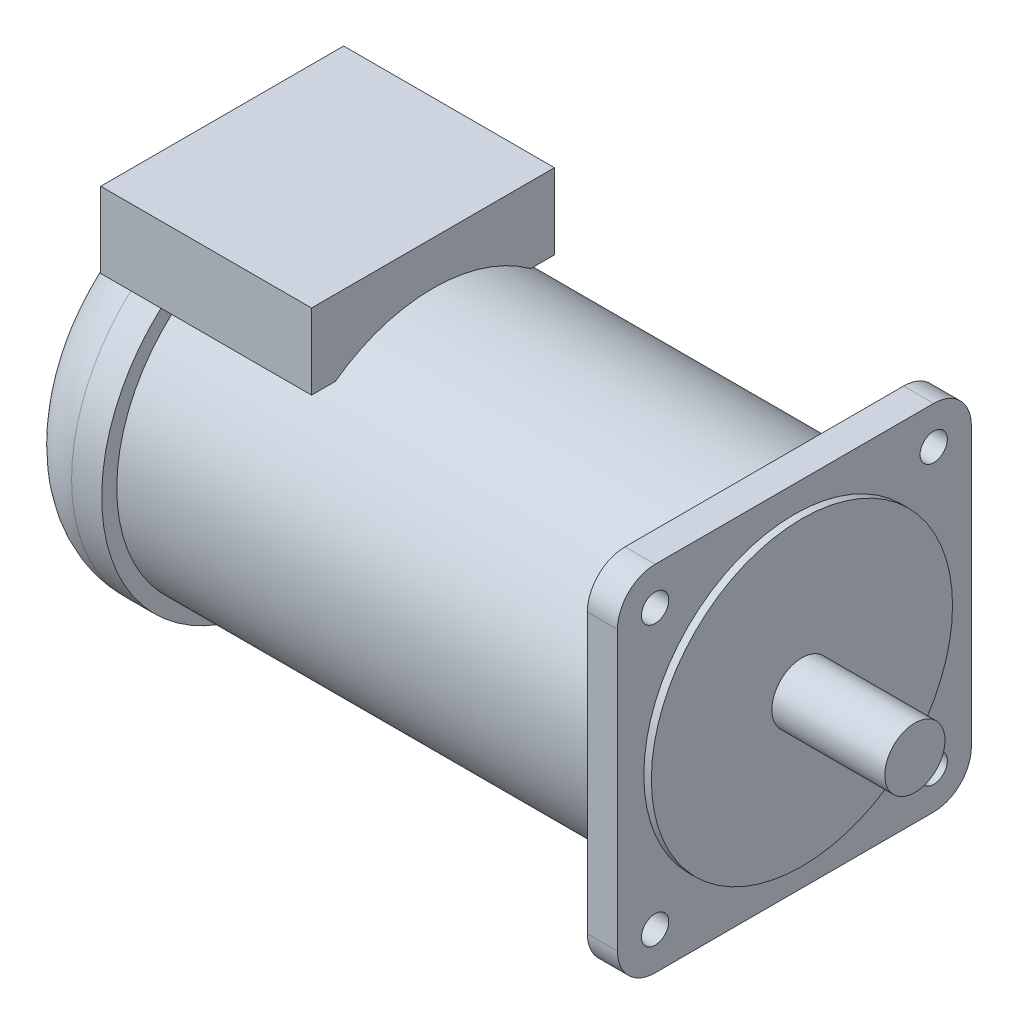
ISO-10303-21;
HEADER;
FILE_DESCRIPTION(('STEP AP214'),'2;1');
FILE_NAME('part.step','',(''),(''),'','','');
FILE_SCHEMA(('AUTOMOTIVE_DESIGN { 1 0 10303 214 1 1 1 1 }'));
ENDSEC;
DATA;
#1=APPLICATION_CONTEXT('core data for automotive mechanical design processes');
#2=APPLICATION_PROTOCOL_DEFINITION('international standard','automotive_design',2000,#1);
#3=PRODUCT_CONTEXT('',#1,'mechanical');
#4=PRODUCT('Part','Part','',(#3));
#5=PRODUCT_RELATED_PRODUCT_CATEGORY('part','',(#4));
#6=PRODUCT_DEFINITION_FORMATION('','',#4);
#7=PRODUCT_DEFINITION_CONTEXT('part definition',#1,'design');
#8=PRODUCT_DEFINITION('design','',#6,#7);
#9=PRODUCT_DEFINITION_SHAPE('','',#8);
#10=(LENGTH_UNIT() NAMED_UNIT(*) SI_UNIT(.MILLI.,.METRE.));
#11=(NAMED_UNIT(*) PLANE_ANGLE_UNIT() SI_UNIT($,.RADIAN.));
#12=(NAMED_UNIT(*) SI_UNIT($,.STERADIAN.) SOLID_ANGLE_UNIT());
#13=UNCERTAINTY_MEASURE_WITH_UNIT(LENGTH_MEASURE(1.E-05),#10,'distance_accuracy_value','');
#14=(GEOMETRIC_REPRESENTATION_CONTEXT(3) GLOBAL_UNCERTAINTY_ASSIGNED_CONTEXT((#13)) GLOBAL_UNIT_ASSIGNED_CONTEXT((#10,
#11,#12)) REPRESENTATION_CONTEXT('',''));
#15=CARTESIAN_POINT('',(0.,0.,0.));
#16=DIRECTION('',(0.,0.,1.));
#17=DIRECTION('',(1.,0.,0.));
#18=AXIS2_PLACEMENT_3D('',#15,#16,#17);
#19=CARTESIAN_POINT('',(-50.8,12.7,0.));
#20=DIRECTION('',(-1.,0.,0.));
#21=DIRECTION('',(0.,0.,1.));
#22=AXIS2_PLACEMENT_3D('',#19,#20,#21);
#23=PLANE('',#22);
#24=CARTESIAN_POINT('',(-50.8,58.7375000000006,-58.7374999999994));
#25=DIRECTION('',(-1.,0.,0.));
#26=DIRECTION('',(0.,0.,1.));
#27=AXIS2_PLACEMENT_3D('',#24,#25,#26);
#28=CIRCLE('',#27,5.75436999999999);
#29=CARTESIAN_POINT('',(-50.8,58.7375000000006,-52.9831299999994));
#30=VERTEX_POINT('',#29);
#31=EDGE_CURVE('E523',#30,#30,#28,.T.);
#32=ORIENTED_EDGE('',*,*,#31,.T.);
#33=EDGE_LOOP('',(#32));
#34=FACE_BOUND('',#33,.T.);
#35=CARTESIAN_POINT('',(-50.8,-58.7374999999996,-58.7375000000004));
#36=DIRECTION('',(-1.,0.,0.));
#37=DIRECTION('',(0.,0.,1.));
#38=AXIS2_PLACEMENT_3D('',#35,#36,#37);
#39=CIRCLE('',#38,5.75436999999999);
#40=CARTESIAN_POINT('',(-50.8,-58.7374999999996,-52.9831300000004));
#41=VERTEX_POINT('',#40);
#42=EDGE_CURVE('E527',#41,#41,#39,.T.);
#43=ORIENTED_EDGE('',*,*,#42,.T.);
#44=EDGE_LOOP('',(#43));
#45=FACE_BOUND('',#44,.T.);
#46=CARTESIAN_POINT('',(-50.8,-58.7375000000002,58.7374999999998));
#47=DIRECTION('',(-1.,0.,0.));
#48=DIRECTION('',(0.,0.,1.));
#49=AXIS2_PLACEMENT_3D('',#46,#47,#48);
#50=CIRCLE('',#49,5.75436999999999);
#51=CARTESIAN_POINT('',(-50.8,-58.7375000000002,64.4918699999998));
#52=VERTEX_POINT('',#51);
#53=EDGE_CURVE('E536',#52,#52,#50,.T.);
#54=ORIENTED_EDGE('',*,*,#53,.T.);
#55=EDGE_LOOP('',(#54));
#56=FACE_BOUND('',#55,.T.);
#57=CARTESIAN_POINT('',(-50.8,58.7375,58.7375));
#58=DIRECTION('',(-1.,0.,0.));
#59=DIRECTION('',(0.,0.,1.));
#60=AXIS2_PLACEMENT_3D('',#57,#58,#59);
#61=CIRCLE('',#60,5.75436999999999);
#62=CARTESIAN_POINT('',(-50.8,58.7375,64.49187));
#63=VERTEX_POINT('',#62);
#64=EDGE_CURVE('E541',#63,#63,#61,.T.);
#65=ORIENTED_EDGE('',*,*,#64,.T.);
#66=EDGE_LOOP('',(#65));
#67=FACE_BOUND('',#66,.T.);
#68=CARTESIAN_POINT('',(-50.8,58.7375,-58.7375));
#69=DIRECTION('',(1.,0.,0.));
#70=DIRECTION('',(0.,0.,-1.));
#71=AXIS2_PLACEMENT_3D('',#68,#69,#70);
#72=CIRCLE('',#71,15.875);
#73=CARTESIAN_POINT('',(-50.8,58.7375,-74.6125));
#74=VERTEX_POINT('',#73);
#75=CARTESIAN_POINT('',(-50.8,74.6125,-58.7375));
#76=VERTEX_POINT('',#75);
#77=EDGE_CURVE('E209',#74,#76,#72,.T.);
#78=ORIENTED_EDGE('',*,*,#77,.T.);
#79=DIRECTION('',(0.,0.,1.));
#80=VECTOR('',#79,1.);
#81=CARTESIAN_POINT('',(-50.8,74.6125,-58.7375));
#82=LINE('',#81,#80);
#83=CARTESIAN_POINT('',(-50.8,74.6125,58.7375));
#84=VERTEX_POINT('',#83);
#85=EDGE_CURVE('E212',#76,#84,#82,.T.);
#86=ORIENTED_EDGE('',*,*,#85,.T.);
#87=CARTESIAN_POINT('',(-50.8,58.7375,58.7375));
#88=DIRECTION('',(-1.,0.,0.));
#89=DIRECTION('',(0.,0.,1.));
#90=AXIS2_PLACEMENT_3D('',#87,#88,#89);
#91=CIRCLE('',#90,15.875);
#92=CARTESIAN_POINT('',(-50.8,58.7375,74.6125));
#93=VERTEX_POINT('',#92);
#94=EDGE_CURVE('E215',#93,#84,#91,.T.);
#95=ORIENTED_EDGE('',*,*,#94,.F.);
#96=DIRECTION('',(0.,1.,0.));
#97=VECTOR('',#96,1.);
#98=CARTESIAN_POINT('',(-50.8,-58.7375,74.6125));
#99=LINE('',#98,#97);
#100=CARTESIAN_POINT('',(-50.8,-58.7375,74.6125));
#101=VERTEX_POINT('',#100);
#102=EDGE_CURVE('E218',#101,#93,#99,.T.);
#103=ORIENTED_EDGE('',*,*,#102,.F.);
#104=CARTESIAN_POINT('',(-50.8,-58.7375,58.7375));
#105=DIRECTION('',(1.,0.,0.));
#106=DIRECTION('',(0.,0.,-1.));
#107=AXIS2_PLACEMENT_3D('',#104,#105,#106);
#108=CIRCLE('',#107,15.875);
#109=CARTESIAN_POINT('',(-50.8,-74.6125,58.7375));
#110=VERTEX_POINT('',#109);
#111=EDGE_CURVE('E220',#101,#110,#108,.T.);
#112=ORIENTED_EDGE('',*,*,#111,.T.);
#113=DIRECTION('',(0.,0.,1.));
#114=VECTOR('',#113,1.);
#115=CARTESIAN_POINT('',(-50.8,-74.6125,-58.7375));
#116=LINE('',#115,#114);
#117=CARTESIAN_POINT('',(-50.8,-74.6125,-58.7375));
#118=VERTEX_POINT('',#117);
#119=EDGE_CURVE('E223',#118,#110,#116,.T.);
#120=ORIENTED_EDGE('',*,*,#119,.F.);
#121=CARTESIAN_POINT('',(-50.8,-58.7375,-58.7375));
#122=DIRECTION('',(-1.,0.,0.));
#123=DIRECTION('',(0.,0.,1.));
#124=AXIS2_PLACEMENT_3D('',#121,#122,#123);
#125=CIRCLE('',#124,15.875);
#126=CARTESIAN_POINT('',(-50.8,-58.7375,-74.6125));
#127=VERTEX_POINT('',#126);
#128=EDGE_CURVE('E226',#127,#118,#125,.T.);
#129=ORIENTED_EDGE('',*,*,#128,.F.);
#130=DIRECTION('',(0.,1.,0.));
#131=VECTOR('',#130,1.);
#132=CARTESIAN_POINT('',(-50.8,-58.7375,-74.6125));
#133=LINE('',#132,#131);
#134=EDGE_CURVE('E228',#127,#74,#133,.T.);
#135=ORIENTED_EDGE('',*,*,#134,.T.);
#136=EDGE_LOOP('',(#78,#86,#95,#103,#112,#120,#129,#135));
#137=FACE_BOUND('',#136,.T.);
#138=CARTESIAN_POINT('',(-50.8,0.,0.));
#139=DIRECTION('',(-1.,0.,0.));
#140=DIRECTION('',(0.,0.,1.));
#141=AXIS2_PLACEMENT_3D('',#138,#139,#140);
#142=CIRCLE('',#141,63.5);
#143=CARTESIAN_POINT('',(-50.8,0.,63.5));
#144=VERTEX_POINT('',#143);
#145=EDGE_CURVE('E11',#144,#144,#142,.F.);
#146=ORIENTED_EDGE('',*,*,#145,.F.);
#147=EDGE_LOOP('',(#146));
#148=FACE_BOUND('',#147,.T.);
#149=ADVANCED_FACE('F30',(#34,#45,#56,#67,#137,#148),#23,.F.);
#150=CARTESIAN_POINT('',(0.,0.,0.));
#151=DIRECTION('',(-1.,0.,0.));
#152=DIRECTION('',(0.,0.,1.));
#153=AXIS2_PLACEMENT_3D('',#150,#151,#152);
#154=CYLINDRICAL_SURFACE('',#153,69.85);
#155=CARTESIAN_POINT('',(-63.5,0.,0.));
#156=DIRECTION('',(1.,0.,0.));
#157=DIRECTION('',(0.,0.,-1.));
#158=AXIS2_PLACEMENT_3D('',#155,#156,#157);
#159=CIRCLE('',#158,69.85);
#160=CARTESIAN_POINT('',(-63.5,0.,-69.85));
#161=VERTEX_POINT('',#160);
#162=EDGE_CURVE('E284',#161,#161,#159,.T.);
#163=ORIENTED_EDGE('',*,*,#162,.F.);
#164=EDGE_LOOP('',(#163));
#165=FACE_BOUND('',#164,.T.);
#166=DIRECTION('',(-1.,0.,0.));
#167=VECTOR('',#166,1.);
#168=CARTESIAN_POINT('',(0.,56.4141009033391,-41.1882473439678));
#169=LINE('',#168,#167);
#170=CARTESIAN_POINT('',(-203.2,56.4141009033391,-41.1882473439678));
#171=VERTEX_POINT('',#170);
#172=CARTESIAN_POINT('',(-266.7,56.4141009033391,-41.1882473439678));
#173=VERTEX_POINT('',#172);
#174=EDGE_CURVE('E50',#171,#173,#169,.T.);
#175=ORIENTED_EDGE('',*,*,#174,.F.);
#176=CARTESIAN_POINT('',(-203.2,0.,0.));
#177=DIRECTION('',(1.,0.,0.));
#178=DIRECTION('',(0.,0.,-1.));
#179=AXIS2_PLACEMENT_3D('',#176,#177,#178);
#180=CIRCLE('',#179,69.85);
#181=CARTESIAN_POINT('',(-203.2,56.4141009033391,41.1882473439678));
#182=VERTEX_POINT('',#181);
#183=EDGE_CURVE('E39',#171,#182,#180,.T.);
#184=ORIENTED_EDGE('',*,*,#183,.T.);
#185=DIRECTION('',(-1.,0.,0.));
#186=VECTOR('',#185,1.);
#187=CARTESIAN_POINT('',(0.,56.4141009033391,41.1882473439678));
#188=LINE('',#187,#186);
#189=CARTESIAN_POINT('',(-266.7,56.4141009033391,41.1882473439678));
#190=VERTEX_POINT('',#189);
#191=EDGE_CURVE('E164',#190,#182,#188,.F.);
#192=ORIENTED_EDGE('',*,*,#191,.F.);
#193=CARTESIAN_POINT('',(-266.7,0.,0.));
#194=DIRECTION('',(-1.,0.,0.));
#195=DIRECTION('',(0.,0.,1.));
#196=AXIS2_PLACEMENT_3D('',#193,#194,#195);
#197=CIRCLE('',#196,69.85);
#198=EDGE_CURVE('E278',#173,#190,#197,.T.);
#199=ORIENTED_EDGE('',*,*,#198,.F.);
#200=EDGE_LOOP('',(#175,#184,#192,#199));
#201=FACE_BOUND('',#200,.T.);
#202=ADVANCED_FACE('F359',(#165,#201),#154,.T.);
#203=CARTESIAN_POINT('',(-266.7,69.85,0.));
#204=DIRECTION('',(-1.,0.,0.));
#205=DIRECTION('',(0.,0.,1.));
#206=AXIS2_PLACEMENT_3D('',#203,#204,#205);
#207=PLANE('',#206);
#208=DIRECTION('',(0.,0.,-1.));
#209=VECTOR('',#208,1.);
#210=CARTESIAN_POINT('',(-266.7,56.4141009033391,0.));
#211=LINE('',#210,#209);
#212=CARTESIAN_POINT('',(-266.7,56.4141009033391,51.2239125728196));
#213=VERTEX_POINT('',#212);
#214=EDGE_CURVE('E206',#213,#190,#211,.T.);
#215=ORIENTED_EDGE('',*,*,#214,.F.);
#216=CARTESIAN_POINT('',(-266.7,0.,0.));
#217=DIRECTION('',(-1.,0.,0.));
#218=DIRECTION('',(0.,0.,1.));
#219=AXIS2_PLACEMENT_3D('',#216,#217,#218);
#220=CIRCLE('',#219,76.2);
#221=CARTESIAN_POINT('',(-266.7,56.4141009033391,-51.2239125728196));
#222=VERTEX_POINT('',#221);
#223=EDGE_CURVE('E275',#222,#213,#220,.T.);
#224=ORIENTED_EDGE('',*,*,#223,.F.);
#225=EDGE_CURVE('E196',#173,#222,#211,.T.);
#226=ORIENTED_EDGE('',*,*,#225,.F.);
#227=ORIENTED_EDGE('',*,*,#198,.T.);
#228=EDGE_LOOP('',(#215,#224,#226,#227));
#229=FACE_BOUND('',#228,.T.);
#230=ADVANCED_FACE('F366',(#229),#207,.F.);
#231=CARTESIAN_POINT('',(0.,0.,0.));
#232=DIRECTION('',(-1.,0.,0.));
#233=DIRECTION('',(0.,0.,1.));
#234=AXIS2_PLACEMENT_3D('',#231,#232,#233);
#235=CYLINDRICAL_SURFACE('',#234,76.2);
#236=DIRECTION('',(1.,0.,0.));
#237=VECTOR('',#236,1.);
#238=CARTESIAN_POINT('',(-292.1,56.4141009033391,-51.2239125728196));
#239=LINE('',#238,#237);
#240=CARTESIAN_POINT('',(-279.4,56.4141009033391,-51.2239125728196));
#241=VERTEX_POINT('',#240);
#242=EDGE_CURVE('E201',#241,#222,#239,.T.);
#243=ORIENTED_EDGE('',*,*,#242,.T.);
#244=ORIENTED_EDGE('',*,*,#223,.T.);
#245=DIRECTION('',(1.,0.,0.));
#246=VECTOR('',#245,1.);
#247=CARTESIAN_POINT('',(-292.1,56.4141009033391,51.2239125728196));
#248=LINE('',#247,#246);
#249=CARTESIAN_POINT('',(-279.4,56.4141009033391,51.2239125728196));
#250=VERTEX_POINT('',#249);
#251=EDGE_CURVE('E155',#250,#213,#248,.T.);
#252=ORIENTED_EDGE('',*,*,#251,.F.);
#253=CARTESIAN_POINT('',(-279.4,0.,0.));
#254=DIRECTION('',(-1.,0.,0.));
#255=DIRECTION('',(0.,0.,1.));
#256=AXIS2_PLACEMENT_3D('',#253,#254,#255);
#257=CIRCLE('',#256,76.2);
#258=EDGE_CURVE('E272',#241,#250,#257,.T.);
#259=ORIENTED_EDGE('',*,*,#258,.F.);
#260=EDGE_LOOP('',(#243,#244,#252,#259));
#261=FACE_BOUND('',#260,.T.);
#262=ADVANCED_FACE('F356',(#261),#235,.T.);
#263=CARTESIAN_POINT('',(-279.4,0.,0.));
#264=DIRECTION('',(-1.,0.,0.));
#265=DIRECTION('',(0.,0.,1.));
#266=AXIS2_PLACEMENT_3D('',#263,#264,#265);
#267=TOROIDAL_SURFACE('',#266,50.8,25.4);
#268=CARTESIAN_POINT('',(-304.8,0.,0.));
#269=DIRECTION('',(-1.,0.,0.));
#270=DIRECTION('',(0.,0.,1.));
#271=AXIS2_PLACEMENT_3D('',#268,#269,#270);
#272=CIRCLE('',#271,50.8);
#273=CARTESIAN_POINT('',(-304.8,0.,50.8));
#274=VERTEX_POINT('',#273);
#275=EDGE_CURVE('E254',#274,#274,#272,.T.);
#276=ORIENTED_EDGE('',*,*,#275,.F.);
#277=EDGE_LOOP('',(#276));
#278=FACE_BOUND('',#277,.T.);
#279=CARTESIAN_POINT('',(-304.171795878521,56.4141009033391,0.));
#280=CARTESIAN_POINT('',(-304.171796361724,56.4141009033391,0.956930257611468));
#281=CARTESIAN_POINT('',(-304.166311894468,56.4141009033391,1.91386076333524));
#282=CARTESIAN_POINT('',(-304.143968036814,56.4141009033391,3.82759498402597));
#283=CARTESIAN_POINT('',(-304.127108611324,56.4141009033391,4.78439869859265));
#284=CARTESIAN_POINT('',(-304.080796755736,56.4141009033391,6.6979265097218));
#285=CARTESIAN_POINT('',(-304.051341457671,56.4141009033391,7.65465053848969));
#286=CARTESIAN_POINT('',(-303.977844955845,56.4141009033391,9.5675451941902));
#287=CARTESIAN_POINT('',(-303.933803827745,56.4141009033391,10.5237158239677));
#288=CARTESIAN_POINT('',(-303.828436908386,56.4141009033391,12.4344908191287));
#289=CARTESIAN_POINT('',(-303.767122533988,56.4141009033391,13.3890958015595));
#290=CARTESIAN_POINT('',(-303.62377580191,56.4141009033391,15.2968000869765));
#291=CARTESIAN_POINT('',(-303.54174291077,56.4141009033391,16.2498993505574));
#292=CARTESIAN_POINT('',(-303.35293644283,56.4141009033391,18.1533166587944));
#293=CARTESIAN_POINT('',(-303.246172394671,56.4141009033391,19.1036356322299));
#294=CARTESIAN_POINT('',(-303.003252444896,56.4141009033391,21.0004651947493));
#295=CARTESIAN_POINT('',(-302.867099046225,56.4141009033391,21.9469761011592));
#296=CARTESIAN_POINT('',(-302.528618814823,56.4141009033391,24.0288729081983));
#297=CARTESIAN_POINT('',(-302.318438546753,56.4141009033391,25.1630106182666));
#298=CARTESIAN_POINT('',(-301.8377744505,56.4141009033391,27.4188033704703));
#299=CARTESIAN_POINT('',(-301.567282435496,56.4141009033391,28.5404566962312));
#300=CARTESIAN_POINT('',(-300.955546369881,56.4141009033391,30.7630537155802));
#301=CARTESIAN_POINT('',(-300.614390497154,56.4141009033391,31.8640213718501));
#302=CARTESIAN_POINT('',(-299.849837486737,56.4141009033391,34.0370389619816));
#303=CARTESIAN_POINT('',(-299.426474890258,56.4141009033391,35.1091008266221));
#304=CARTESIAN_POINT('',(-298.632925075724,56.4141009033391,36.8833604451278));
#305=CARTESIAN_POINT('',(-298.287368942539,56.4141009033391,37.5965828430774));
#306=CARTESIAN_POINT('',(-297.548408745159,56.4141009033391,38.9979592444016));
#307=CARTESIAN_POINT('',(-297.155004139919,56.4141009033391,39.6861129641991));
#308=CARTESIAN_POINT('',(-296.317469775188,56.4141009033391,41.0303483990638));
#309=CARTESIAN_POINT('',(-295.873382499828,56.4141009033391,41.6864563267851));
#310=CARTESIAN_POINT('',(-295.167426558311,56.4141009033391,42.6408478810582));
#311=CARTESIAN_POINT('',(-294.925491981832,56.4141009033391,42.9539920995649));
#312=CARTESIAN_POINT('',(-294.428023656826,56.4141009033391,43.5694303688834));
#313=CARTESIAN_POINT('',(-294.172486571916,56.4141009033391,43.8717217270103));
#314=CARTESIAN_POINT('',(-293.508994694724,56.4141009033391,44.6208269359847));
#315=CARTESIAN_POINT('',(-293.091862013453,56.4141009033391,45.0595869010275));
#316=CARTESIAN_POINT('',(-292.22565215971,56.4141009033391,45.9041967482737));
#317=CARTESIAN_POINT('',(-291.776583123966,56.4141009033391,46.3100549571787));
#318=CARTESIAN_POINT('',(-290.847339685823,56.4141009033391,47.0838498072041));
#319=CARTESIAN_POINT('',(-290.367188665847,56.4141009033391,47.4518144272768));
#320=CARTESIAN_POINT('',(-289.376939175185,56.4141009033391,48.1450209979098));
#321=CARTESIAN_POINT('',(-288.866845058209,56.4141009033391,48.470269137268));
#322=CARTESIAN_POINT('',(-287.898794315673,56.4141009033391,49.0270815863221));
#323=CARTESIAN_POINT('',(-287.444700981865,56.4141009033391,49.2653711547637));
#324=CARTESIAN_POINT('',(-286.518747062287,56.4141009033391,49.7045222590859));
#325=CARTESIAN_POINT('',(-286.046888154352,56.4141009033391,49.9053873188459));
#326=CARTESIAN_POINT('',(-285.088097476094,56.4141009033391,50.2668573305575));
#327=CARTESIAN_POINT('',(-284.601169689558,56.4141009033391,50.4274728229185));
#328=CARTESIAN_POINT('',(-283.615232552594,56.4141009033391,50.706106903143));
#329=CARTESIAN_POINT('',(-283.116223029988,56.4141009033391,50.8241248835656));
#330=CARTESIAN_POINT('',(-282.107853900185,56.4141009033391,51.0160339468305));
#331=CARTESIAN_POINT('',(-281.598462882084,56.4141009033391,51.0897605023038));
#332=CARTESIAN_POINT('',(-280.575102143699,56.4141009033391,51.1911707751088));
#333=CARTESIAN_POINT('',(-280.061132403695,56.4141009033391,51.2188542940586));
#334=CARTESIAN_POINT('',(-279.032822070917,56.4141009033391,51.2277056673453));
#335=CARTESIAN_POINT('',(-278.518481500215,56.4141009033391,51.208876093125));
#336=CARTESIAN_POINT('',(-277.493601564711,56.4141009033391,51.1250269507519));
#337=CARTESIAN_POINT('',(-276.983062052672,56.4141009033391,51.0600091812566));
#338=CARTESIAN_POINT('',(-276.00134206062,56.4141009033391,50.8903382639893));
#339=CARTESIAN_POINT('',(-275.529688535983,56.4141009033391,50.7884017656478));
#340=CARTESIAN_POINT('',(-274.596328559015,56.4141009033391,50.5463399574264));
#341=CARTESIAN_POINT('',(-274.13462158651,56.4141009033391,50.4062166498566));
#342=CARTESIAN_POINT('',(-273.22390336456,56.4141009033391,50.0896916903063));
#343=CARTESIAN_POINT('',(-272.774890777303,56.4141009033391,49.913293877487));
#344=CARTESIAN_POINT('',(-271.891801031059,56.4141009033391,49.5264391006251));
#345=CARTESIAN_POINT('',(-271.457724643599,56.4141009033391,49.3159803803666));
#346=CARTESIAN_POINT('',(-270.582143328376,56.4141009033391,48.8505696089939));
#347=CARTESIAN_POINT('',(-270.141623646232,56.4141009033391,48.593766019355));
#348=CARTESIAN_POINT('',(-269.281094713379,56.4141009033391,48.0479193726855));
#349=CARTESIAN_POINT('',(-268.861085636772,56.4141009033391,47.7588760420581));
#350=CARTESIAN_POINT('',(-268.042494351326,56.4141009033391,47.1514412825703));
#351=CARTESIAN_POINT('',(-267.643925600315,56.4141009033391,46.8330317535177));
#352=CARTESIAN_POINT('',(-266.869161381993,56.4141009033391,46.1700097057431));
#353=CARTESIAN_POINT('',(-266.492970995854,56.4141009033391,45.8253912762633));
#354=CARTESIAN_POINT('',(-265.573395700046,56.4141009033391,44.9273553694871));
#355=CARTESIAN_POINT('',(-265.044895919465,56.4141009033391,44.3586169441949));
#356=CARTESIAN_POINT('',(-264.040222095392,56.4141009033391,43.1766299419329));
#357=CARTESIAN_POINT('',(-263.564070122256,56.4141009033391,42.5633627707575));
#358=CARTESIAN_POINT('',(-262.662396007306,56.4141009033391,41.300374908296));
#359=CARTESIAN_POINT('',(-262.236899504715,56.4141009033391,40.6506359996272));
#360=CARTESIAN_POINT('',(-261.434198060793,56.4141009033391,39.321826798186));
#361=CARTESIAN_POINT('',(-261.057009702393,56.4141009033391,38.6427465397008));
#362=CARTESIAN_POINT('',(-260.42153356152,56.4141009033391,37.404586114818));
#363=CARTESIAN_POINT('',(-260.154804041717,56.4141009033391,36.8498007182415));
#364=CARTESIAN_POINT('',(-259.648278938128,56.4141009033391,35.7282744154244));
#365=CARTESIAN_POINT('',(-259.408477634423,56.4141009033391,35.1615360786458));
#366=CARTESIAN_POINT('',(-258.726451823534,56.4141009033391,33.4455957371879));
#367=CARTESIAN_POINT('',(-258.321894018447,56.4141009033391,32.2812422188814));
#368=CARTESIAN_POINT('',(-257.779472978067,56.4141009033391,30.5129303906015));
#369=CARTESIAN_POINT('',(-257.609094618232,56.4141009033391,29.9185135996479));
#370=CARTESIAN_POINT('',(-257.288458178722,56.4141009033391,28.724240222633));
#371=CARTESIAN_POINT('',(-257.138199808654,56.4141009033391,28.1243837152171));
#372=CARTESIAN_POINT('',(-256.856206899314,56.4141009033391,26.9206748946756));
#373=CARTESIAN_POINT('',(-256.724463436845,56.4141009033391,26.3168246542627));
#374=CARTESIAN_POINT('',(-256.477791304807,56.4141009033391,25.1057176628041));
#375=CARTESIAN_POINT('',(-256.362862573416,56.4141009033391,24.4984609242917));
#376=CARTESIAN_POINT('',(-256.100603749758,56.4141009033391,23.0109334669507));
#377=CARTESIAN_POINT('',(-255.961555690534,56.4141009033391,22.129201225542));
#378=CARTESIAN_POINT('',(-255.71090396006,56.4141009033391,20.3618028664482));
#379=CARTESIAN_POINT('',(-255.599303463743,56.4141009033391,19.4761363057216));
#380=CARTESIAN_POINT('',(-255.399539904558,56.4141009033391,17.7017703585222));
#381=CARTESIAN_POINT('',(-255.311387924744,56.4141009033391,16.8130697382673));
#382=CARTESIAN_POINT('',(-255.155036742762,56.4141009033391,15.0339712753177));
#383=CARTESIAN_POINT('',(-255.086836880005,56.4141009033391,14.1435734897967));
#384=CARTESIAN_POINT('',(-254.967141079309,56.4141009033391,12.3593881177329));
#385=CARTESIAN_POINT('',(-254.915688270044,56.4141009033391,11.4655976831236));
#386=CARTESIAN_POINT('',(-254.82711503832,56.4141009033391,9.67731288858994));
#387=CARTESIAN_POINT('',(-254.789994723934,56.4141009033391,8.78281852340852));
#388=CARTESIAN_POINT('',(-254.728026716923,56.4141009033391,6.99362840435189));
#389=CARTESIAN_POINT('',(-254.703176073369,56.4141009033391,6.09893275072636));
#390=CARTESIAN_POINT('',(-254.664242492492,56.4141009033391,4.30931496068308));
#391=CARTESIAN_POINT('',(-254.650159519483,56.4141009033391,3.41439282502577));
#392=CARTESIAN_POINT('',(-254.631840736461,56.4141009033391,1.62157837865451));
#393=CARTESIAN_POINT('',(-254.627636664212,56.4141009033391,0.723685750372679));
#394=CARTESIAN_POINT('',(-254.628893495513,56.4141009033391,-1.07209466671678));
#395=CARTESIAN_POINT('',(-254.634354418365,56.4141009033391,-1.96998245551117));
#396=CARTESIAN_POINT('',(-254.655299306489,56.4141009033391,-3.76578799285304));
#397=CARTESIAN_POINT('',(-254.670784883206,56.4141009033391,-4.66370572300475));
#398=CARTESIAN_POINT('',(-254.712761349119,56.4141009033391,-6.45928542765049));
#399=CARTESIAN_POINT('',(-254.739252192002,56.4141009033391,-7.35694740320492));
#400=CARTESIAN_POINT('',(-254.804758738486,56.4141009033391,-9.1499762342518));
#401=CARTESIAN_POINT('',(-254.843748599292,56.4141009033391,-10.0453440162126));
#402=CARTESIAN_POINT('',(-254.936420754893,56.4141009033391,-11.835349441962));
#403=CARTESIAN_POINT('',(-254.990103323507,56.4141009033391,-12.7299870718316));
#404=CARTESIAN_POINT('',(-255.114834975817,56.4141009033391,-14.517826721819));
#405=CARTESIAN_POINT('',(-255.185879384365,56.4141009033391,-15.4110290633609));
#406=CARTESIAN_POINT('',(-255.348527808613,56.4141009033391,-17.1955361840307));
#407=CARTESIAN_POINT('',(-255.44013053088,56.4141009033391,-18.0868410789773));
#408=CARTESIAN_POINT('',(-255.629405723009,56.4141009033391,-19.7108884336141));
#409=CARTESIAN_POINT('',(-255.723209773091,56.4141009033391,-20.4440795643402));
#410=CARTESIAN_POINT('',(-255.92958386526,56.4141009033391,-21.9078474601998));
#411=CARTESIAN_POINT('',(-256.042154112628,56.4141009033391,-22.6384241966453));
#412=CARTESIAN_POINT('',(-256.288581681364,56.4141009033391,-24.0964135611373));
#413=CARTESIAN_POINT('',(-256.422450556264,56.4141009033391,-24.8238242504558));
#414=CARTESIAN_POINT('',(-256.714058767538,56.4141009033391,-26.2738681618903));
#415=CARTESIAN_POINT('',(-256.871797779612,56.4141009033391,-26.9965014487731));
#416=CARTESIAN_POINT('',(-257.212584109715,56.4141009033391,-28.4298310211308));
#417=CARTESIAN_POINT('',(-257.395423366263,56.4141009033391,-29.1405764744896));
#418=CARTESIAN_POINT('',(-257.790179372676,56.4141009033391,-30.5540327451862));
#419=CARTESIAN_POINT('',(-258.002097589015,56.4141009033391,-31.2567431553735));
#420=CARTESIAN_POINT('',(-258.457735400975,56.4141009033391,-32.6511821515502));
#421=CARTESIAN_POINT('',(-258.701428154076,56.4141009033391,-33.3429194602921));
#422=CARTESIAN_POINT('',(-259.22366095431,56.4141009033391,-34.7130359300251));
#423=CARTESIAN_POINT('',(-259.502194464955,56.4141009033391,-35.3914175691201));
#424=CARTESIAN_POINT('',(-260.094883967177,56.4141009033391,-36.7265449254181));
#425=CARTESIAN_POINT('',(-260.4087625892,56.4141009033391,-37.3834131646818));
#426=CARTESIAN_POINT('',(-261.076502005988,56.4141009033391,-38.67654085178));
#427=CARTESIAN_POINT('',(-261.430359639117,56.4141009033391,-39.3128019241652));
#428=CARTESIAN_POINT('',(-262.181525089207,56.4141009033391,-40.5614386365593));
#429=CARTESIAN_POINT('',(-262.578939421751,56.4141009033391,-41.1737505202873));
#430=CARTESIAN_POINT('',(-263.418498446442,56.4141009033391,-42.3668533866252));
#431=CARTESIAN_POINT('',(-263.860633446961,56.4141009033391,-42.9476511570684));
#432=CARTESIAN_POINT('',(-264.797155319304,56.4141009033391,-44.0783693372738));
#433=CARTESIAN_POINT('',(-265.292141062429,56.4141009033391,-44.6277965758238));
#434=CARTESIAN_POINT('',(-266.330072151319,56.4141009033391,-45.6796132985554));
#435=CARTESIAN_POINT('',(-266.873022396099,56.4141009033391,-46.1819979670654));
#436=CARTESIAN_POINT('',(-268.004620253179,56.4141009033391,-47.1296982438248));
#437=CARTESIAN_POINT('',(-268.593142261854,56.4141009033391,-47.5751623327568));
#438=CARTESIAN_POINT('',(-269.508524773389,56.4141009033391,-48.1944107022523));
#439=CARTESIAN_POINT('',(-269.819042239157,56.4141009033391,-48.3926458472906));
#440=CARTESIAN_POINT('',(-270.450601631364,56.4141009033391,-48.7718076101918));
#441=CARTESIAN_POINT('',(-270.771646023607,56.4141009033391,-48.9527301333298));
#442=CARTESIAN_POINT('',(-271.544011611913,56.4141009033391,-49.3595065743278));
#443=CARTESIAN_POINT('',(-271.999636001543,56.4141009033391,-49.5772597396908));
#444=CARTESIAN_POINT('',(-272.926910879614,56.4141009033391,-49.975140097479));
#445=CARTESIAN_POINT('',(-273.398557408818,56.4141009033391,-50.1552765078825));
#446=CARTESIAN_POINT('',(-274.355184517,56.4141009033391,-50.4754465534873));
#447=CARTESIAN_POINT('',(-274.840161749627,56.4141009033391,-50.6154901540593));
#448=CARTESIAN_POINT('',(-275.820393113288,56.4141009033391,-50.8534394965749));
#449=CARTESIAN_POINT('',(-276.315647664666,56.4141009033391,-50.9513435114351));
#450=CARTESIAN_POINT('',(-277.314371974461,56.4141009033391,-51.1036987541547));
#451=CARTESIAN_POINT('',(-277.817862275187,56.4141009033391,-51.1580157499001));
#452=CARTESIAN_POINT('',(-278.827682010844,56.4141009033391,-51.2218048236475));
#453=CARTESIAN_POINT('',(-279.334011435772,56.4141009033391,-51.2312770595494));
#454=CARTESIAN_POINT('',(-280.345486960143,56.4141009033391,-51.2052213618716));
#455=CARTESIAN_POINT('',(-280.850633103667,56.4141009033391,-51.1696951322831));
#456=CARTESIAN_POINT('',(-281.855803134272,56.4141009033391,-51.0542301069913));
#457=CARTESIAN_POINT('',(-282.35582714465,56.4141009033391,-50.974292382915));
#458=CARTESIAN_POINT('',(-283.32357581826,56.4141009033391,-50.776098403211));
#459=CARTESIAN_POINT('',(-283.791710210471,56.4141009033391,-50.6598314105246));
#460=CARTESIAN_POINT('',(-284.71699122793,56.4141009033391,-50.3897931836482));
#461=CARTESIAN_POINT('',(-285.174138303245,56.4141009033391,-50.236023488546));
#462=CARTESIAN_POINT('',(-286.07490639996,56.4141009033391,-49.8930030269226));
#463=CARTESIAN_POINT('',(-286.518526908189,56.4141009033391,-49.7037509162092));
#464=CARTESIAN_POINT('',(-287.390091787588,56.4141009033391,-49.2920931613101));
#465=CARTESIAN_POINT('',(-287.818035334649,56.4141009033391,-49.0696857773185));
#466=CARTESIAN_POINT('',(-288.685411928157,56.4141009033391,-48.5778473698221));
#467=CARTESIAN_POINT('',(-289.123605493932,56.4141009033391,-48.3062323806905));
#468=CARTESIAN_POINT('',(-289.978532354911,56.4141009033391,-47.7311865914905));
#469=CARTESIAN_POINT('',(-290.395265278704,56.4141009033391,-47.427755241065));
#470=CARTESIAN_POINT('',(-291.206366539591,56.4141009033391,-46.7921484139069));
#471=CARTESIAN_POINT('',(-291.600727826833,56.4141009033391,-46.4599639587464));
#472=CARTESIAN_POINT('',(-292.366415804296,56.4141009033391,-45.7699804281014));
#473=CARTESIAN_POINT('',(-292.737737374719,56.4141009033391,-45.4121756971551));
#474=CARTESIAN_POINT('',(-293.653471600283,56.4141009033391,-44.4723416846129));
#475=CARTESIAN_POINT('',(-294.18175367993,56.4141009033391,-43.8745111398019));
#476=CARTESIAN_POINT('',(-295.183427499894,56.4141009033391,-42.6344743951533));
#477=CARTESIAN_POINT('',(-295.656794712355,56.4141009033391,-41.9922485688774));
#478=CARTESIAN_POINT('',(-296.551346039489,56.4141009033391,-40.6709615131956));
#479=CARTESIAN_POINT('',(-296.972438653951,56.4141009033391,-39.9918386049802));
#480=CARTESIAN_POINT('',(-297.764363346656,56.4141009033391,-38.6051582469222));
#481=CARTESIAN_POINT('',(-298.135197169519,56.4141009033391,-37.8976017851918));
#482=CARTESIAN_POINT('',(-299.044977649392,56.4141009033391,-36.0155639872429));
#483=CARTESIAN_POINT('',(-299.546174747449,56.4141009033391,-34.8227740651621));
#484=CARTESIAN_POINT('',(-300.44223198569,56.4141009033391,-32.397851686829));
#485=CARTESIAN_POINT('',(-300.837015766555,56.4141009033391,-31.1656916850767));
#486=CARTESIAN_POINT('',(-301.536832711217,56.4141009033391,-28.6737125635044));
#487=CARTESIAN_POINT('',(-301.84167398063,56.4141009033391,-27.413840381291));
#488=CARTESIAN_POINT('',(-302.375813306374,56.4141009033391,-24.8787914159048));
#489=CARTESIAN_POINT('',(-302.605127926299,56.4141009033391,-23.6036180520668));
#490=CARTESIAN_POINT('',(-302.946731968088,56.4141009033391,-21.4022169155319));
#491=CARTESIAN_POINT('',(-303.073811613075,56.4141009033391,-20.4782119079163));
#492=CARTESIAN_POINT('',(-303.300819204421,56.4141009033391,-18.6268349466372));
#493=CARTESIAN_POINT('',(-303.400745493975,56.4141009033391,-17.699462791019));
#494=CARTESIAN_POINT('',(-303.577687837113,56.4141009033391,-15.8422988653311));
#495=CARTESIAN_POINT('',(-303.654697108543,56.4141009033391,-14.9125064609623));
#496=CARTESIAN_POINT('',(-303.78945059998,56.4141009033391,-13.0515661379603));
#497=CARTESIAN_POINT('',(-303.847195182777,56.4141009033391,-12.1204182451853));
#498=CARTESIAN_POINT('',(-303.946522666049,56.4141009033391,-10.2572844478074));
#499=CARTESIAN_POINT('',(-303.988105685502,56.4141009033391,-9.32529854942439));
#500=CARTESIAN_POINT('',(-304.057582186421,56.4141009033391,-7.46082390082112));
#501=CARTESIAN_POINT('',(-304.08547562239,56.4141009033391,-6.52833514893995));
#502=CARTESIAN_POINT('',(-304.129368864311,56.4141009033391,-4.66326441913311));
#503=CARTESIAN_POINT('',(-304.145370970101,56.4141009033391,-3.73068249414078));
#504=CARTESIAN_POINT('',(-304.166584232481,56.4141009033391,-1.86540045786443));
#505=CARTESIAN_POINT('',(-304.171795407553,56.4141009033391,-0.932700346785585));
#506=CARTESIAN_POINT('',(-304.171795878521,56.4141009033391,0.));
#507=B_SPLINE_CURVE_WITH_KNOTS('',3,(#279,#280,#281,#282,#283,#284,#285,#286,#287,#288,#289,
#290,#291,#292,#293,#294,#295,#296,#297,#298,#299,#300,#301,#302,#303,#304,#305,#306,#307,#308,
#309,#310,#311,#312,#313,#314,#315,#316,#317,#318,#319,#320,#321,#322,#323,#324,#325,#326,#327,
#328,#329,#330,#331,#332,#333,#334,#335,#336,#337,#338,#339,#340,#341,#342,#343,#344,#345,#346,
#347,#348,#349,#350,#351,#352,#353,#354,#355,#356,#357,#358,#359,#360,#361,#362,#363,#364,#365,
#366,#367,#368,#369,#370,#371,#372,#373,#374,#375,#376,#377,#378,#379,#380,#381,#382,#383,#384,
#385,#386,#387,#388,#389,#390,#391,#392,#393,#394,#395,#396,#397,#398,#399,#400,#401,#402,#403,
#404,#405,#406,#407,#408,#409,#410,#411,#412,#413,#414,#415,#416,#417,#418,#419,#420,#421,#422,
#423,#424,#425,#426,#427,#428,#429,#430,#431,#432,#433,#434,#435,#436,#437,#438,#439,#440,#441,
#442,#443,#444,#445,#446,#447,#448,#449,#450,#451,#452,#453,#454,#455,#456,#457,#458,#459,#460,
#461,#462,#463,#464,#465,#466,#467,#468,#469,#470,#471,#472,#473,#474,#475,#476,#477,#478,#479,
#480,#481,#482,#483,#484,#485,#486,#487,#488,#489,#490,#491,#492,#493,#494,#495,#496,#497,#498,
#499,#500,#501,#502,#503,#504,#505,#506),.UNSPECIFIED.,.T.,.F.,(4,2,2,2,2,2,2,2,2,2,2,2,2,2,2,2,
2,2,2,2,2,2,2,2,2,2,2,2,2,2,2,2,2,2,2,2,2,2,2,2,2,2,2,2,2,2,2,2,2,2,2,2,2,2,2,2,2,2,2,2,2,2,2,2,
2,2,2,2,2,2,2,2,2,2,2,2,2,2,2,2,2,2,2,2,2,2,2,2,2,2,2,2,2,2,2,2,2,2,2,2,2,2,2,2,2,2,2,2,2,2,2,2,
2,4),(0.,2.87077471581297,5.74155828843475,8.61299586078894,11.4844185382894,14.3539477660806,
17.2235508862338,20.0920502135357,22.9603053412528,26.4192826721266,29.8787298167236,
33.3338858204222,36.7875931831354,39.1635802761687,41.5395942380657,43.91363096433,
45.1004537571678,46.2875690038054,48.1020769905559,49.9161243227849,51.7288224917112,
53.5412577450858,55.0781504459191,56.6148983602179,58.1512434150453,59.6876103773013,
61.2296496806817,62.7716956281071,64.3136563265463,65.8555569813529,67.3015583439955,
68.7474839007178,70.1932565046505,71.6391036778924,73.1673076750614,74.6955246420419,
76.2246899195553,77.754201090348,80.0797702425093,82.4063161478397,84.7340346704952,
87.062550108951,88.9085304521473,90.7541179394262,94.4472128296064,96.302046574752,
98.1568535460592,100.01076351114,101.864666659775,104.542012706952,107.219668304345,
109.898587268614,112.577417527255,115.263092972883,117.948788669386,120.633838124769,
123.318878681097,126.012533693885,128.706194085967,131.40028758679,134.094369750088,
136.782917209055,139.471514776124,142.159389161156,144.847094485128,147.064389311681,
149.281708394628,151.500234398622,153.718730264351,155.919837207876,158.121055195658,
160.320425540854,162.519383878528,164.702152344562,166.884748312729,169.072806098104,
171.2603907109,173.476109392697,175.692054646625,177.902096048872,179.006824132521,
180.111812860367,181.625113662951,183.138043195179,184.65059635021,186.16321149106,
187.680467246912,189.197717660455,190.714910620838,192.232066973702,193.677529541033,
195.122932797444,196.56839082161,198.013924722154,199.559042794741,201.104187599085,
202.649816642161,204.195787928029,206.585469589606,208.97621453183,211.37108687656,
213.765876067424,217.640751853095,221.518400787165,225.404263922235,229.289274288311,
232.086972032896,234.884840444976,237.68353604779,240.482178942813,243.280801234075,
246.079432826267,248.877523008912,251.675608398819),.UNSPECIFIED.);
#508=CARTESIAN_POINT('',(-292.1,56.4141009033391,46.009336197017));
#509=VERTEX_POINT('',#508);
#510=EDGE_CURVE('E297',#509,#250,#507,.T.);
#511=ORIENTED_EDGE('',*,*,#510,.F.);
#512=CARTESIAN_POINT('',(-292.1,0.,0.));
#513=DIRECTION('',(1.,0.,0.));
#514=DIRECTION('',(0.,0.,-1.));
#515=AXIS2_PLACEMENT_3D('',#512,#513,#514);
#516=CIRCLE('',#515,72.7970452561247);
#517=CARTESIAN_POINT('',(-292.1,56.4141009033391,-46.009336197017));
#518=VERTEX_POINT('',#517);
#519=EDGE_CURVE('E287',#518,#509,#516,.T.);
#520=ORIENTED_EDGE('',*,*,#519,.F.);
#521=EDGE_CURVE('E290',#241,#518,#507,.T.);
#522=ORIENTED_EDGE('',*,*,#521,.F.);
#523=ORIENTED_EDGE('',*,*,#258,.T.);
#524=EDGE_LOOP('',(#511,#520,#522,#523));
#525=FACE_BOUND('',#524,.T.);
#526=ADVANCED_FACE('F298',(#278,#525),#267,.T.);
#527=CARTESIAN_POINT('',(-304.8,50.8,0.));
#528=DIRECTION('',(1.,0.,0.));
#529=DIRECTION('',(0.,0.,-1.));
#530=AXIS2_PLACEMENT_3D('',#527,#528,#529);
#531=PLANE('',#530);
#532=ORIENTED_EDGE('',*,*,#275,.T.);
#533=EDGE_LOOP('',(#532));
#534=FACE_BOUND('',#533,.T.);
#535=ADVANCED_FACE('F318',(#534),#531,.F.);
#536=CARTESIAN_POINT('',(-63.5,58.7375,-58.7375));
#537=DIRECTION('',(1.,0.,0.));
#538=DIRECTION('',(0.,0.,-1.));
#539=AXIS2_PLACEMENT_3D('',#536,#537,#538);
#540=PLANE('',#539);
#541=CARTESIAN_POINT('',(-63.5,58.7375000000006,-58.7374999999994));
#542=DIRECTION('',(-1.,0.,0.));
#543=DIRECTION('',(0.,0.,1.));
#544=AXIS2_PLACEMENT_3D('',#541,#542,#543);
#545=CIRCLE('',#544,5.75436999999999);
#546=CARTESIAN_POINT('',(-63.5,58.7375000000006,-52.9831299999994));
#547=VERTEX_POINT('',#546);
#548=EDGE_CURVE('E521',#547,#547,#545,.T.);
#549=ORIENTED_EDGE('',*,*,#548,.F.);
#550=EDGE_LOOP('',(#549));
#551=FACE_BOUND('',#550,.T.);
#552=CARTESIAN_POINT('',(-63.5,-58.7374999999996,-58.7375000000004));
#553=DIRECTION('',(-1.,0.,0.));
#554=DIRECTION('',(0.,0.,1.));
#555=AXIS2_PLACEMENT_3D('',#552,#553,#554);
#556=CIRCLE('',#555,5.75436999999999);
#557=CARTESIAN_POINT('',(-63.5,-58.7374999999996,-52.9831300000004));
#558=VERTEX_POINT('',#557);
#559=EDGE_CURVE('E524',#558,#558,#556,.T.);
#560=ORIENTED_EDGE('',*,*,#559,.F.);
#561=EDGE_LOOP('',(#560));
#562=FACE_BOUND('',#561,.T.);
#563=CARTESIAN_POINT('',(-63.5,-58.7375000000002,58.7374999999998));
#564=DIRECTION('',(-1.,0.,0.));
#565=DIRECTION('',(0.,0.,1.));
#566=AXIS2_PLACEMENT_3D('',#563,#564,#565);
#567=CIRCLE('',#566,5.75436999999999);
#568=CARTESIAN_POINT('',(-63.5,-58.7375000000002,64.4918699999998));
#569=VERTEX_POINT('',#568);
#570=EDGE_CURVE('E533',#569,#569,#567,.T.);
#571=ORIENTED_EDGE('',*,*,#570,.F.);
#572=EDGE_LOOP('',(#571));
#573=FACE_BOUND('',#572,.T.);
#574=CARTESIAN_POINT('',(-63.5,58.7375,58.7375));
#575=DIRECTION('',(-1.,0.,0.));
#576=DIRECTION('',(0.,0.,1.));
#577=AXIS2_PLACEMENT_3D('',#574,#575,#576);
#578=CIRCLE('',#577,5.75436999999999);
#579=CARTESIAN_POINT('',(-63.5,58.7375,64.49187));
#580=VERTEX_POINT('',#579);
#581=EDGE_CURVE('E539',#580,#580,#578,.T.);
#582=ORIENTED_EDGE('',*,*,#581,.F.);
#583=EDGE_LOOP('',(#582));
#584=FACE_BOUND('',#583,.T.);
#585=CARTESIAN_POINT('',(-63.5,58.7375,-58.7375));
#586=DIRECTION('',(1.,0.,0.));
#587=DIRECTION('',(0.,0.,-1.));
#588=AXIS2_PLACEMENT_3D('',#585,#586,#587);
#589=CIRCLE('',#588,15.875);
#590=CARTESIAN_POINT('',(-63.5,58.7375,-74.6125));
#591=VERTEX_POINT('',#590);
#592=CARTESIAN_POINT('',(-63.5,74.6125,-58.7375));
#593=VERTEX_POINT('',#592);
#594=EDGE_CURVE('E231',#591,#593,#589,.T.);
#595=ORIENTED_EDGE('',*,*,#594,.F.);
#596=DIRECTION('',(0.,1.,0.));
#597=VECTOR('',#596,1.);
#598=CARTESIAN_POINT('',(-63.5,-58.7375,-74.6125));
#599=LINE('',#598,#597);
#600=CARTESIAN_POINT('',(-63.5,-58.7375,-74.6125));
#601=VERTEX_POINT('',#600);
#602=EDGE_CURVE('E248',#601,#591,#599,.T.);
#603=ORIENTED_EDGE('',*,*,#602,.F.);
#604=CARTESIAN_POINT('',(-63.5,-58.7375,-58.7375));
#605=DIRECTION('',(-1.,0.,0.));
#606=DIRECTION('',(0.,0.,1.));
#607=AXIS2_PLACEMENT_3D('',#604,#605,#606);
#608=CIRCLE('',#607,15.875);
#609=CARTESIAN_POINT('',(-63.5,-74.6125,-58.7375));
#610=VERTEX_POINT('',#609);
#611=EDGE_CURVE('E246',#601,#610,#608,.T.);
#612=ORIENTED_EDGE('',*,*,#611,.T.);
#613=DIRECTION('',(0.,0.,1.));
#614=VECTOR('',#613,1.);
#615=CARTESIAN_POINT('',(-63.5,-74.6125,-58.7375));
#616=LINE('',#615,#614);
#617=CARTESIAN_POINT('',(-63.5,-74.6125,58.7375));
#618=VERTEX_POINT('',#617);
#619=EDGE_CURVE('E244',#610,#618,#616,.T.);
#620=ORIENTED_EDGE('',*,*,#619,.T.);
#621=CARTESIAN_POINT('',(-63.5,-58.7375,58.7375));
#622=DIRECTION('',(1.,0.,0.));
#623=DIRECTION('',(0.,0.,-1.));
#624=AXIS2_PLACEMENT_3D('',#621,#622,#623);
#625=CIRCLE('',#624,15.875);
#626=CARTESIAN_POINT('',(-63.5,-58.7375,74.6125));
#627=VERTEX_POINT('',#626);
#628=EDGE_CURVE('E241',#627,#618,#625,.T.);
#629=ORIENTED_EDGE('',*,*,#628,.F.);
#630=DIRECTION('',(0.,1.,0.));
#631=VECTOR('',#630,1.);
#632=CARTESIAN_POINT('',(-63.5,-58.7375,74.6125));
#633=LINE('',#632,#631);
#634=CARTESIAN_POINT('',(-63.5,58.7375,74.6125));
#635=VERTEX_POINT('',#634);
#636=EDGE_CURVE('E239',#627,#635,#633,.T.);
#637=ORIENTED_EDGE('',*,*,#636,.T.);
#638=CARTESIAN_POINT('',(-63.5,58.7375,58.7375));
#639=DIRECTION('',(-1.,0.,0.));
#640=DIRECTION('',(0.,0.,1.));
#641=AXIS2_PLACEMENT_3D('',#638,#639,#640);
#642=CIRCLE('',#641,15.875);
#643=CARTESIAN_POINT('',(-63.5,74.6125,58.7375));
#644=VERTEX_POINT('',#643);
#645=EDGE_CURVE('E237',#635,#644,#642,.T.);
#646=ORIENTED_EDGE('',*,*,#645,.T.);
#647=DIRECTION('',(0.,0.,1.));
#648=VECTOR('',#647,1.);
#649=CARTESIAN_POINT('',(-63.5,74.6125,-58.7375));
#650=LINE('',#649,#648);
#651=EDGE_CURVE('E234',#593,#644,#650,.T.);
#652=ORIENTED_EDGE('',*,*,#651,.F.);
#653=EDGE_LOOP('',(#595,#603,#612,#620,#629,#637,#646,#652));
#654=FACE_BOUND('',#653,.T.);
#655=ORIENTED_EDGE('',*,*,#162,.T.);
#656=EDGE_LOOP('',(#655));
#657=FACE_BOUND('',#656,.T.);
#658=ADVANCED_FACE('F314',(#551,#562,#573,#584,#654,#657),#540,.F.);
#659=CARTESIAN_POINT('',(-63.5,58.7375,-58.7375));
#660=DIRECTION('',(1.,0.,0.));
#661=DIRECTION('',(0.,0.,-1.));
#662=AXIS2_PLACEMENT_3D('',#659,#660,#661);
#663=CYLINDRICAL_SURFACE('',#662,15.875);
#664=ORIENTED_EDGE('',*,*,#77,.F.);
#665=DIRECTION('',(1.,0.,0.));
#666=VECTOR('',#665,1.);
#667=CARTESIAN_POINT('',(-63.5,58.7375,-74.6125));
#668=LINE('',#667,#666);
#669=EDGE_CURVE('E252',#591,#74,#668,.T.);
#670=ORIENTED_EDGE('',*,*,#669,.F.);
#671=ORIENTED_EDGE('',*,*,#594,.T.);
#672=DIRECTION('',(1.,0.,0.));
#673=VECTOR('',#672,1.);
#674=CARTESIAN_POINT('',(-63.5,74.6125,-58.7375));
#675=LINE('',#674,#673);
#676=EDGE_CURVE('E251',#593,#76,#675,.T.);
#677=ORIENTED_EDGE('',*,*,#676,.T.);
#678=EDGE_LOOP('',(#664,#670,#671,#677));
#679=FACE_BOUND('',#678,.T.);
#680=ADVANCED_FACE('F317',(#679),#663,.T.);
#681=CARTESIAN_POINT('',(-63.5,-58.7375,-74.6125));
#682=DIRECTION('',(0.,0.,-1.));
#683=DIRECTION('',(-1.,0.,0.));
#684=AXIS2_PLACEMENT_3D('',#681,#682,#683);
#685=PLANE('',#684);
#686=ORIENTED_EDGE('',*,*,#134,.F.);
#687=DIRECTION('',(1.,0.,0.));
#688=VECTOR('',#687,1.);
#689=CARTESIAN_POINT('',(-63.5,-58.7375,-74.6125));
#690=LINE('',#689,#688);
#691=EDGE_CURVE('E255',#601,#127,#690,.T.);
#692=ORIENTED_EDGE('',*,*,#691,.F.);
#693=ORIENTED_EDGE('',*,*,#602,.T.);
#694=ORIENTED_EDGE('',*,*,#669,.T.);
#695=EDGE_LOOP('',(#686,#692,#693,#694));
#696=FACE_BOUND('',#695,.T.);
#697=ADVANCED_FACE('F320',(#696),#685,.T.);
#698=CARTESIAN_POINT('',(-63.5,-58.7375,-58.7375));
#699=DIRECTION('',(1.,0.,0.));
#700=DIRECTION('',(0.,0.,-1.));
#701=AXIS2_PLACEMENT_3D('',#698,#699,#700);
#702=CYLINDRICAL_SURFACE('',#701,15.875);
#703=ORIENTED_EDGE('',*,*,#128,.T.);
#704=DIRECTION('',(1.,0.,0.));
#705=VECTOR('',#704,1.);
#706=CARTESIAN_POINT('',(-63.5,-74.6125,-58.7375));
#707=LINE('',#706,#705);
#708=EDGE_CURVE('E257',#610,#118,#707,.T.);
#709=ORIENTED_EDGE('',*,*,#708,.F.);
#710=ORIENTED_EDGE('',*,*,#611,.F.);
#711=ORIENTED_EDGE('',*,*,#691,.T.);
#712=EDGE_LOOP('',(#703,#709,#710,#711));
#713=FACE_BOUND('',#712,.T.);
#714=ADVANCED_FACE('F323',(#713),#702,.T.);
#715=CARTESIAN_POINT('',(-63.5,-74.6125,-58.7375));
#716=DIRECTION('',(0.,1.,0.));
#717=DIRECTION('',(0.,0.,1.));
#718=AXIS2_PLACEMENT_3D('',#715,#716,#717);
#719=PLANE('',#718);
#720=ORIENTED_EDGE('',*,*,#119,.T.);
#721=DIRECTION('',(1.,0.,0.));
#722=VECTOR('',#721,1.);
#723=CARTESIAN_POINT('',(-63.5,-74.6125,58.7375));
#724=LINE('',#723,#722);
#725=EDGE_CURVE('E260',#618,#110,#724,.T.);
#726=ORIENTED_EDGE('',*,*,#725,.F.);
#727=ORIENTED_EDGE('',*,*,#619,.F.);
#728=ORIENTED_EDGE('',*,*,#708,.T.);
#729=EDGE_LOOP('',(#720,#726,#727,#728));
#730=FACE_BOUND('',#729,.T.);
#731=ADVANCED_FACE('F327',(#730),#719,.F.);
#732=CARTESIAN_POINT('',(-63.5,-58.7375,58.7375));
#733=DIRECTION('',(1.,0.,0.));
#734=DIRECTION('',(0.,0.,-1.));
#735=AXIS2_PLACEMENT_3D('',#732,#733,#734);
#736=CYLINDRICAL_SURFACE('',#735,15.875);
#737=ORIENTED_EDGE('',*,*,#111,.F.);
#738=DIRECTION('',(1.,0.,0.));
#739=VECTOR('',#738,1.);
#740=CARTESIAN_POINT('',(-63.5,-58.7375,74.6125));
#741=LINE('',#740,#739);
#742=EDGE_CURVE('E262',#627,#101,#741,.T.);
#743=ORIENTED_EDGE('',*,*,#742,.F.);
#744=ORIENTED_EDGE('',*,*,#628,.T.);
#745=ORIENTED_EDGE('',*,*,#725,.T.);
#746=EDGE_LOOP('',(#737,#743,#744,#745));
#747=FACE_BOUND('',#746,.T.);
#748=ADVANCED_FACE('F331',(#747),#736,.T.);
#749=CARTESIAN_POINT('',(-63.5,-58.7375,74.6125));
#750=DIRECTION('',(0.,0.,-1.));
#751=DIRECTION('',(-1.,0.,0.));
#752=AXIS2_PLACEMENT_3D('',#749,#750,#751);
#753=PLANE('',#752);
#754=ORIENTED_EDGE('',*,*,#102,.T.);
#755=DIRECTION('',(1.,0.,0.));
#756=VECTOR('',#755,1.);
#757=CARTESIAN_POINT('',(-63.5,58.7375,74.6125));
#758=LINE('',#757,#756);
#759=EDGE_CURVE('E264',#635,#93,#758,.T.);
#760=ORIENTED_EDGE('',*,*,#759,.F.);
#761=ORIENTED_EDGE('',*,*,#636,.F.);
#762=ORIENTED_EDGE('',*,*,#742,.T.);
#763=EDGE_LOOP('',(#754,#760,#761,#762));
#764=FACE_BOUND('',#763,.T.);
#765=ADVANCED_FACE('F335',(#764),#753,.F.);
#766=CARTESIAN_POINT('',(-63.5,58.7375,58.7375));
#767=DIRECTION('',(1.,0.,0.));
#768=DIRECTION('',(0.,0.,-1.));
#769=AXIS2_PLACEMENT_3D('',#766,#767,#768);
#770=CYLINDRICAL_SURFACE('',#769,15.875);
#771=ORIENTED_EDGE('',*,*,#94,.T.);
#772=DIRECTION('',(1.,0.,0.));
#773=VECTOR('',#772,1.);
#774=CARTESIAN_POINT('',(-63.5,74.6125,58.7375));
#775=LINE('',#774,#773);
#776=EDGE_CURVE('E267',#644,#84,#775,.T.);
#777=ORIENTED_EDGE('',*,*,#776,.F.);
#778=ORIENTED_EDGE('',*,*,#645,.F.);
#779=ORIENTED_EDGE('',*,*,#759,.T.);
#780=EDGE_LOOP('',(#771,#777,#778,#779));
#781=FACE_BOUND('',#780,.T.);
#782=ADVANCED_FACE('F339',(#781),#770,.T.);
#783=CARTESIAN_POINT('',(-63.5,74.6125,-58.7375));
#784=DIRECTION('',(0.,1.,0.));
#785=DIRECTION('',(0.,0.,1.));
#786=AXIS2_PLACEMENT_3D('',#783,#784,#785);
#787=PLANE('',#786);
#788=ORIENTED_EDGE('',*,*,#85,.F.);
#789=ORIENTED_EDGE('',*,*,#676,.F.);
#790=ORIENTED_EDGE('',*,*,#651,.T.);
#791=ORIENTED_EDGE('',*,*,#776,.T.);
#792=EDGE_LOOP('',(#788,#789,#790,#791));
#793=FACE_BOUND('',#792,.T.);
#794=ADVANCED_FACE('F343',(#793),#787,.T.);
#795=CARTESIAN_POINT('',(-203.2,88.2412082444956,51.2239125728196));
#796=DIRECTION('',(1.,0.,0.));
#797=DIRECTION('',(0.,0.,-1.));
#798=AXIS2_PLACEMENT_3D('',#795,#796,#797);
#799=PLANE('',#798);
#800=ORIENTED_EDGE('',*,*,#183,.F.);
#801=DIRECTION('',(0.,0.,1.));
#802=VECTOR('',#801,1.);
#803=CARTESIAN_POINT('',(-203.2,56.4141009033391,-51.2239125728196));
#804=LINE('',#803,#802);
#805=CARTESIAN_POINT('',(-203.2,56.4141009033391,-51.2239125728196));
#806=VERTEX_POINT('',#805);
#807=EDGE_CURVE('E166',#806,#171,#804,.T.);
#808=ORIENTED_EDGE('',*,*,#807,.F.);
#809=DIRECTION('',(0.,1.,0.));
#810=VECTOR('',#809,1.);
#811=CARTESIAN_POINT('',(-203.2,56.4141009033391,-51.2239125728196));
#812=LINE('',#811,#810);
#813=CARTESIAN_POINT('',(-203.2,88.2412082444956,-51.2239125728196));
#814=VERTEX_POINT('',#813);
#815=EDGE_CURVE('E180',#806,#814,#812,.T.);
#816=ORIENTED_EDGE('',*,*,#815,.T.);
#817=DIRECTION('',(0.,0.,-1.));
#818=VECTOR('',#817,1.);
#819=CARTESIAN_POINT('',(-203.2,88.2412082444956,51.2239125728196));
#820=LINE('',#819,#818);
#821=CARTESIAN_POINT('',(-203.2,88.2412082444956,51.2239125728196));
#822=VERTEX_POINT('',#821);
#823=EDGE_CURVE('E172',#822,#814,#820,.T.);
#824=ORIENTED_EDGE('',*,*,#823,.F.);
#825=DIRECTION('',(0.,-1.,0.));
#826=VECTOR('',#825,1.);
#827=CARTESIAN_POINT('',(-203.2,88.2412082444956,51.2239125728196));
#828=LINE('',#827,#826);
#829=CARTESIAN_POINT('',(-203.2,56.4141009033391,51.2239125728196));
#830=VERTEX_POINT('',#829);
#831=EDGE_CURVE('E153',#822,#830,#828,.T.);
#832=ORIENTED_EDGE('',*,*,#831,.T.);
#833=EDGE_CURVE('E162',#182,#830,#804,.T.);
#834=ORIENTED_EDGE('',*,*,#833,.F.);
#835=EDGE_LOOP('',(#800,#808,#816,#824,#832,#834));
#836=FACE_BOUND('',#835,.T.);
#837=ADVANCED_FACE('F169',(#836),#799,.T.);
#838=CARTESIAN_POINT('',(-292.1,56.4141009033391,-51.2239125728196));
#839=DIRECTION('',(0.,1.,0.));
#840=DIRECTION('',(0.,0.,1.));
#841=AXIS2_PLACEMENT_3D('',#838,#839,#840);
#842=PLANE('',#841);
#843=ORIENTED_EDGE('',*,*,#214,.T.);
#844=ORIENTED_EDGE('',*,*,#191,.T.);
#845=ORIENTED_EDGE('',*,*,#833,.T.);
#846=EDGE_CURVE('E149',#213,#830,#248,.T.);
#847=ORIENTED_EDGE('',*,*,#846,.F.);
#848=EDGE_LOOP('',(#843,#844,#845,#847));
#849=FACE_BOUND('',#848,.T.);
#850=ADVANCED_FACE('F163',(#849),#842,.F.);
#851=ORIENTED_EDGE('',*,*,#807,.T.);
#852=ORIENTED_EDGE('',*,*,#174,.T.);
#853=ORIENTED_EDGE('',*,*,#225,.T.);
#854=EDGE_CURVE('E202',#222,#806,#239,.T.);
#855=ORIENTED_EDGE('',*,*,#854,.T.);
#856=EDGE_LOOP('',(#851,#852,#853,#855));
#857=FACE_BOUND('',#856,.T.);
#858=ADVANCED_FACE('F306',(#857),#842,.F.);
#859=DIRECTION('',(0.,0.,1.));
#860=VECTOR('',#859,1.);
#861=CARTESIAN_POINT('',(-292.1,56.4141009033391,-51.2239125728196));
#862=LINE('',#861,#860);
#863=CARTESIAN_POINT('',(-292.1,56.4141009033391,51.2239125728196));
#864=VERTEX_POINT('',#863);
#865=EDGE_CURVE('E186',#509,#864,#862,.T.);
#866=ORIENTED_EDGE('',*,*,#865,.F.);
#867=ORIENTED_EDGE('',*,*,#510,.T.);
#868=EDGE_CURVE('E160',#864,#250,#248,.T.);
#869=ORIENTED_EDGE('',*,*,#868,.F.);
#870=EDGE_LOOP('',(#866,#867,#869));
#871=FACE_BOUND('',#870,.T.);
#872=ADVANCED_FACE('F422',(#871),#842,.F.);
#873=CARTESIAN_POINT('',(-292.1,56.4141009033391,-51.2239125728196));
#874=VERTEX_POINT('',#873);
#875=EDGE_CURVE('E199',#874,#241,#239,.T.);
#876=ORIENTED_EDGE('',*,*,#875,.T.);
#877=ORIENTED_EDGE('',*,*,#521,.T.);
#878=EDGE_CURVE('E187',#874,#518,#862,.T.);
#879=ORIENTED_EDGE('',*,*,#878,.F.);
#880=EDGE_LOOP('',(#876,#877,#879));
#881=FACE_BOUND('',#880,.T.);
#882=ADVANCED_FACE('F307',(#881),#842,.F.);
#883=CARTESIAN_POINT('',(-292.1,88.2412082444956,51.2239125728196));
#884=DIRECTION('',(1.,0.,0.));
#885=DIRECTION('',(0.,0.,-1.));
#886=AXIS2_PLACEMENT_3D('',#883,#884,#885);
#887=PLANE('',#886);
#888=ORIENTED_EDGE('',*,*,#878,.T.);
#889=ORIENTED_EDGE('',*,*,#519,.T.);
#890=ORIENTED_EDGE('',*,*,#865,.T.);
#891=DIRECTION('',(0.,-1.,0.));
#892=VECTOR('',#891,1.);
#893=CARTESIAN_POINT('',(-292.1,88.2412082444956,51.2239125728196));
#894=LINE('',#893,#892);
#895=CARTESIAN_POINT('',(-292.1,88.2412082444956,51.2239125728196));
#896=VERTEX_POINT('',#895);
#897=EDGE_CURVE('E183',#896,#864,#894,.T.);
#898=ORIENTED_EDGE('',*,*,#897,.F.);
#899=DIRECTION('',(0.,0.,-1.));
#900=VECTOR('',#899,1.);
#901=CARTESIAN_POINT('',(-292.1,88.2412082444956,51.2239125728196));
#902=LINE('',#901,#900);
#903=CARTESIAN_POINT('',(-292.1,88.2412082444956,-51.2239125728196));
#904=VERTEX_POINT('',#903);
#905=EDGE_CURVE('E158',#896,#904,#902,.T.);
#906=ORIENTED_EDGE('',*,*,#905,.T.);
#907=DIRECTION('',(0.,1.,0.));
#908=VECTOR('',#907,1.);
#909=CARTESIAN_POINT('',(-292.1,56.4141009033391,-51.2239125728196));
#910=LINE('',#909,#908);
#911=EDGE_CURVE('E190',#874,#904,#910,.T.);
#912=ORIENTED_EDGE('',*,*,#911,.F.);
#913=EDGE_LOOP('',(#888,#889,#890,#898,#906,#912));
#914=FACE_BOUND('',#913,.T.);
#915=ADVANCED_FACE('F313',(#914),#887,.F.);
#916=CARTESIAN_POINT('',(-292.1,88.2412082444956,51.2239125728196));
#917=DIRECTION('',(0.,0.,1.));
#918=DIRECTION('',(1.,0.,0.));
#919=AXIS2_PLACEMENT_3D('',#916,#917,#918);
#920=PLANE('',#919);
#921=ORIENTED_EDGE('',*,*,#831,.F.);
#922=DIRECTION('',(1.,0.,0.));
#923=VECTOR('',#922,1.);
#924=CARTESIAN_POINT('',(-292.1,88.2412082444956,51.2239125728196));
#925=LINE('',#924,#923);
#926=EDGE_CURVE('E194',#896,#822,#925,.T.);
#927=ORIENTED_EDGE('',*,*,#926,.F.);
#928=ORIENTED_EDGE('',*,*,#897,.T.);
#929=ORIENTED_EDGE('',*,*,#868,.T.);
#930=ORIENTED_EDGE('',*,*,#251,.T.);
#931=ORIENTED_EDGE('',*,*,#846,.T.);
#932=EDGE_LOOP('',(#921,#927,#928,#929,#930,#931));
#933=FACE_BOUND('',#932,.T.);
#934=ADVANCED_FACE('F151',(#933),#920,.T.);
#935=CARTESIAN_POINT('',(-292.1,88.2412082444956,51.2239125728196));
#936=DIRECTION('',(0.,-1.,0.));
#937=DIRECTION('',(0.,0.,-1.));
#938=AXIS2_PLACEMENT_3D('',#935,#936,#937);
#939=PLANE('',#938);
#940=ORIENTED_EDGE('',*,*,#823,.T.);
#941=DIRECTION('',(1.,0.,0.));
#942=VECTOR('',#941,1.);
#943=CARTESIAN_POINT('',(-292.1,88.2412082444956,-51.2239125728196));
#944=LINE('',#943,#942);
#945=EDGE_CURVE('E197',#904,#814,#944,.T.);
#946=ORIENTED_EDGE('',*,*,#945,.F.);
#947=ORIENTED_EDGE('',*,*,#905,.F.);
#948=ORIENTED_EDGE('',*,*,#926,.T.);
#949=EDGE_LOOP('',(#940,#946,#947,#948));
#950=FACE_BOUND('',#949,.T.);
#951=ADVANCED_FACE('F312',(#950),#939,.F.);
#952=CARTESIAN_POINT('',(-292.1,56.4141009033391,-51.2239125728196));
#953=DIRECTION('',(0.,0.,-1.));
#954=DIRECTION('',(-1.,0.,0.));
#955=AXIS2_PLACEMENT_3D('',#952,#953,#954);
#956=PLANE('',#955);
#957=ORIENTED_EDGE('',*,*,#815,.F.);
#958=ORIENTED_EDGE('',*,*,#854,.F.);
#959=ORIENTED_EDGE('',*,*,#242,.F.);
#960=ORIENTED_EDGE('',*,*,#875,.F.);
#961=ORIENTED_EDGE('',*,*,#911,.T.);
#962=ORIENTED_EDGE('',*,*,#945,.T.);
#963=EDGE_LOOP('',(#957,#958,#959,#960,#961,#962));
#964=FACE_BOUND('',#963,.T.);
#965=ADVANCED_FACE('F308',(#964),#956,.T.);
#966=CARTESIAN_POINT('',(-47.625,0.,0.));
#967=DIRECTION('',(1.,0.,0.));
#968=DIRECTION('',(0.,0.,-1.));
#969=AXIS2_PLACEMENT_3D('',#966,#967,#968);
#970=PLANE('',#969);
#971=CARTESIAN_POINT('',(-47.625,0.,0.));
#972=DIRECTION('',(1.,0.,0.));
#973=DIRECTION('',(0.,0.,-1.));
#974=AXIS2_PLACEMENT_3D('',#971,#972,#973);
#975=CIRCLE('',#974,63.5);
#976=CARTESIAN_POINT('',(-47.625,0.,-63.5));
#977=VERTEX_POINT('',#976);
#978=EDGE_CURVE('E175',#977,#977,#975,.T.);
#979=ORIENTED_EDGE('',*,*,#978,.T.);
#980=EDGE_LOOP('',(#979));
#981=FACE_BOUND('',#980,.T.);
#982=CARTESIAN_POINT('',(-47.625,0.,0.));
#983=DIRECTION('',(1.,0.,0.));
#984=DIRECTION('',(0.,0.,-1.));
#985=AXIS2_PLACEMENT_3D('',#982,#983,#984);
#986=CIRCLE('',#985,12.7);
#987=CARTESIAN_POINT('',(-47.625,0.,-12.7));
#988=VERTEX_POINT('',#987);
#989=EDGE_CURVE('E34',#988,#988,#986,.T.);
#990=ORIENTED_EDGE('',*,*,#989,.F.);
#991=EDGE_LOOP('',(#990));
#992=FACE_BOUND('',#991,.T.);
#993=ADVANCED_FACE('F388',(#981,#992),#970,.T.);
#994=CARTESIAN_POINT('',(-47.625,0.,0.));
#995=DIRECTION('',(-1.,0.,0.));
#996=DIRECTION('',(0.,0.,1.));
#997=AXIS2_PLACEMENT_3D('',#994,#995,#996);
#998=CYLINDRICAL_SURFACE('',#997,63.5);
#999=ORIENTED_EDGE('',*,*,#978,.F.);
#1000=EDGE_LOOP('',(#999));
#1001=FACE_BOUND('',#1000,.T.);
#1002=ORIENTED_EDGE('',*,*,#145,.T.);
#1003=EDGE_LOOP('',(#1002));
#1004=FACE_BOUND('',#1003,.T.);
#1005=ADVANCED_FACE('F382',(#1001,#1004),#998,.T.);
#1006=CARTESIAN_POINT('',(0.,0.,0.));
#1007=DIRECTION('',(-1.,0.,0.));
#1008=DIRECTION('',(0.,0.,1.));
#1009=AXIS2_PLACEMENT_3D('',#1006,#1007,#1008);
#1010=PLANE('',#1009);
#1011=CARTESIAN_POINT('',(0.,0.,0.));
#1012=DIRECTION('',(-1.,0.,0.));
#1013=DIRECTION('',(0.,0.,1.));
#1014=AXIS2_PLACEMENT_3D('',#1011,#1012,#1013);
#1015=CIRCLE('',#1014,12.7);
#1016=CARTESIAN_POINT('',(0.,0.,12.7));
#1017=VERTEX_POINT('',#1016);
#1018=EDGE_CURVE('E281',#1017,#1017,#1015,.T.);
#1019=ORIENTED_EDGE('',*,*,#1018,.F.);
#1020=EDGE_LOOP('',(#1019));
#1021=FACE_BOUND('',#1020,.T.);
#1022=ADVANCED_FACE('F32',(#1021),#1010,.F.);
#1023=CARTESIAN_POINT('',(0.,0.,0.));
#1024=DIRECTION('',(-1.,0.,0.));
#1025=DIRECTION('',(0.,0.,1.));
#1026=AXIS2_PLACEMENT_3D('',#1023,#1024,#1025);
#1027=CYLINDRICAL_SURFACE('',#1026,12.7);
#1028=ORIENTED_EDGE('',*,*,#989,.T.);
#1029=EDGE_LOOP('',(#1028));
#1030=FACE_BOUND('',#1029,.T.);
#1031=ORIENTED_EDGE('',*,*,#1018,.T.);
#1032=EDGE_LOOP('',(#1031));
#1033=FACE_BOUND('',#1032,.T.);
#1034=ADVANCED_FACE('F372',(#1030,#1033),#1027,.T.);
#1035=CARTESIAN_POINT('',(-63.5,58.7375,58.7375));
#1036=DIRECTION('',(-1.,0.,0.));
#1037=DIRECTION('',(0.,0.,1.));
#1038=AXIS2_PLACEMENT_3D('',#1035,#1036,#1037);
#1039=CYLINDRICAL_SURFACE('',#1038,5.75436999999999);
#1040=ORIENTED_EDGE('',*,*,#581,.T.);
#1041=EDGE_LOOP('',(#1040));
#1042=FACE_BOUND('',#1041,.T.);
#1043=ORIENTED_EDGE('',*,*,#64,.F.);
#1044=EDGE_LOOP('',(#1043));
#1045=FACE_BOUND('',#1044,.T.);
#1046=ADVANCED_FACE('F374',(#1042,#1045),#1039,.F.);
#1047=CARTESIAN_POINT('',(-63.5,-58.7375000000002,58.7374999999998));
#1048=DIRECTION('',(-1.,0.,0.));
#1049=DIRECTION('',(0.,0.,1.));
#1050=AXIS2_PLACEMENT_3D('',#1047,#1048,#1049);
#1051=CYLINDRICAL_SURFACE('',#1050,5.75436999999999);
#1052=ORIENTED_EDGE('',*,*,#570,.T.);
#1053=EDGE_LOOP('',(#1052));
#1054=FACE_BOUND('',#1053,.T.);
#1055=ORIENTED_EDGE('',*,*,#53,.F.);
#1056=EDGE_LOOP('',(#1055));
#1057=FACE_BOUND('',#1056,.T.);
#1058=ADVANCED_FACE('F379',(#1054,#1057),#1051,.F.);
#1059=CARTESIAN_POINT('',(-63.5,-58.7374999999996,-58.7375000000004));
#1060=DIRECTION('',(-1.,0.,0.));
#1061=DIRECTION('',(0.,0.,1.));
#1062=AXIS2_PLACEMENT_3D('',#1059,#1060,#1061);
#1063=CYLINDRICAL_SURFACE('',#1062,5.75436999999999);
#1064=ORIENTED_EDGE('',*,*,#559,.T.);
#1065=EDGE_LOOP('',(#1064));
#1066=FACE_BOUND('',#1065,.T.);
#1067=ORIENTED_EDGE('',*,*,#42,.F.);
#1068=EDGE_LOOP('',(#1067));
#1069=FACE_BOUND('',#1068,.T.);
#1070=ADVANCED_FACE('F501',(#1066,#1069),#1063,.F.);
#1071=CARTESIAN_POINT('',(-63.5,58.7375000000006,-58.7374999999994));
#1072=DIRECTION('',(-1.,0.,0.));
#1073=DIRECTION('',(0.,0.,1.));
#1074=AXIS2_PLACEMENT_3D('',#1071,#1072,#1073);
#1075=CYLINDRICAL_SURFACE('',#1074,5.75436999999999);
#1076=ORIENTED_EDGE('',*,*,#548,.T.);
#1077=EDGE_LOOP('',(#1076));
#1078=FACE_BOUND('',#1077,.T.);
#1079=ORIENTED_EDGE('',*,*,#31,.F.);
#1080=EDGE_LOOP('',(#1079));
#1081=FACE_BOUND('',#1080,.T.);
#1082=ADVANCED_FACE('F508',(#1078,#1081),#1075,.F.);
#1083=CLOSED_SHELL('',(#149,#202,#230,#262,#526,#535,#658,#680,#697,#714,#731,#748,#765,#782,
#794,#837,#850,#858,#872,#882,#915,#934,#951,#965,#993,#1005,#1022,#1034,#1046,#1058,#1070,#1082));
#1084=MANIFOLD_SOLID_BREP('B2',#1083);
#1085=ADVANCED_BREP_SHAPE_REPRESENTATION('',(#18,#1084),#14);
#1086=SHAPE_DEFINITION_REPRESENTATION(#9,#1085);
ENDSEC;
END-ISO-10303-21;
